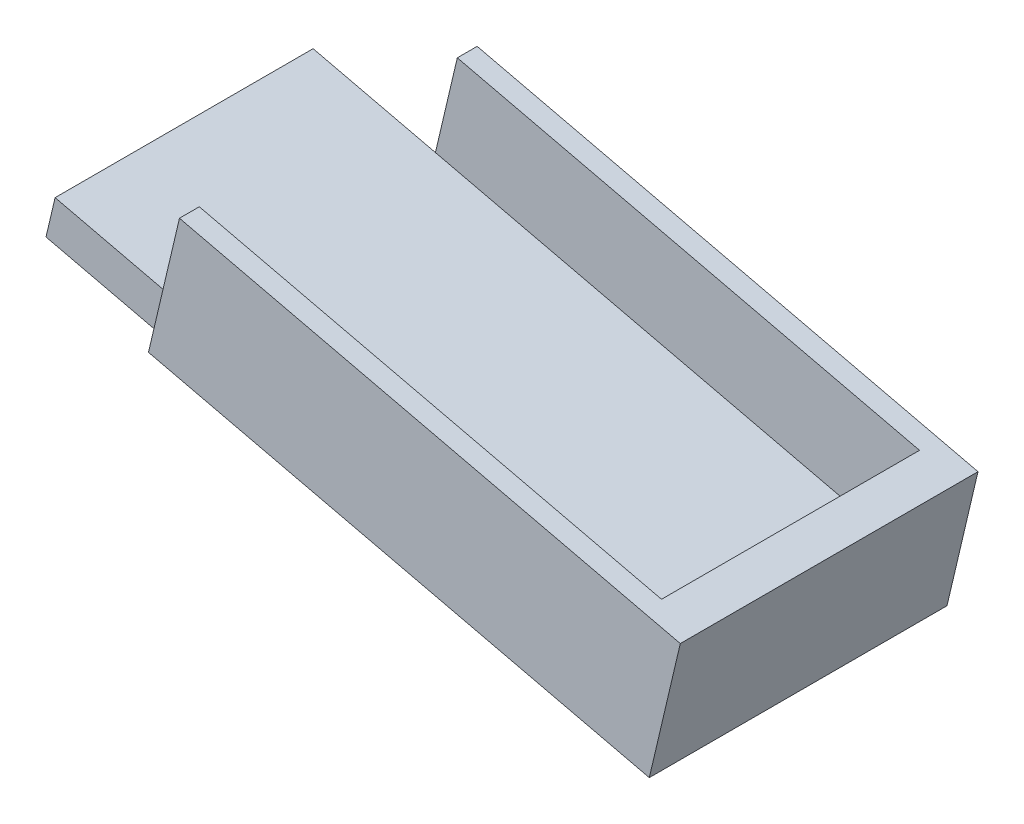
ISO-10303-21;
HEADER;
FILE_DESCRIPTION(('STEP AP214'),'2;1');
FILE_NAME('part.step','',(''),(''),'','','');
FILE_SCHEMA(('AUTOMOTIVE_DESIGN { 1 0 10303 214 1 1 1 1 }'));
ENDSEC;
DATA;
#1=APPLICATION_CONTEXT('core data for automotive mechanical design processes');
#2=APPLICATION_PROTOCOL_DEFINITION('international standard','automotive_design',2000,#1);
#3=PRODUCT_CONTEXT('',#1,'mechanical');
#4=PRODUCT('Part','Part','',(#3));
#5=PRODUCT_RELATED_PRODUCT_CATEGORY('part','',(#4));
#6=PRODUCT_DEFINITION_FORMATION('','',#4);
#7=PRODUCT_DEFINITION_CONTEXT('part definition',#1,'design');
#8=PRODUCT_DEFINITION('design','',#6,#7);
#9=PRODUCT_DEFINITION_SHAPE('','',#8);
#10=(LENGTH_UNIT() NAMED_UNIT(*) SI_UNIT(.MILLI.,.METRE.));
#11=(NAMED_UNIT(*) PLANE_ANGLE_UNIT() SI_UNIT($,.RADIAN.));
#12=(NAMED_UNIT(*) SI_UNIT($,.STERADIAN.) SOLID_ANGLE_UNIT());
#13=UNCERTAINTY_MEASURE_WITH_UNIT(LENGTH_MEASURE(1.E-05),#10,'distance_accuracy_value','');
#14=(GEOMETRIC_REPRESENTATION_CONTEXT(3) GLOBAL_UNCERTAINTY_ASSIGNED_CONTEXT((#13)) GLOBAL_UNIT_ASSIGNED_CONTEXT((#10,
#11,#12)) REPRESENTATION_CONTEXT('',''));
#15=CARTESIAN_POINT('',(0.,0.,0.));
#16=DIRECTION('',(0.,0.,1.));
#17=DIRECTION('',(1.,0.,0.));
#18=AXIS2_PLACEMENT_3D('',#15,#16,#17);
#19=CARTESIAN_POINT('',(161.696938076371,-47.053294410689,65.));
#20=DIRECTION('',(0.,0.,-1.));
#21=DIRECTION('',(-1.,0.,0.));
#22=AXIS2_PLACEMENT_3D('',#19,#20,#21);
#23=PLANE('',#22);
#24=DIRECTION('',(-0.22919193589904,-0.973381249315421,0.));
#25=VECTOR('',#24,1.);
#26=CARTESIAN_POINT('',(35.5202878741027,-17.3437938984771,65.));
#27=LINE('',#26,#25);
#28=CARTESIAN_POINT('',(30.0036065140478,-40.773214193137,65.));
#29=VERTEX_POINT('',#28);
#30=CARTESIAN_POINT('',(27.7116871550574,-50.5070266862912,65.));
#31=VERTEX_POINT('',#30);
#32=EDGE_CURVE('E11',#29,#31,#27,.T.);
#33=ORIENTED_EDGE('',*,*,#32,.F.);
#34=DIRECTION('',(0.973381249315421,-0.229191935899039,0.));
#35=VECTOR('',#34,1.);
#36=CARTESIAN_POINT('',(-0.811545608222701,-33.5174915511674,65.));
#37=LINE('',#36,#35);
#38=CARTESIAN_POINT('',(-0.811545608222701,-33.5174915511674,65.));
#39=VERTEX_POINT('',#38);
#40=EDGE_CURVE('E187',#39,#29,#37,.T.);
#41=ORIENTED_EDGE('',*,*,#40,.F.);
#42=DIRECTION('',(0.229191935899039,0.973381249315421,0.));
#43=VECTOR('',#42,1.);
#44=CARTESIAN_POINT('',(-3.10346496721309,-43.2513040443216,65.));
#45=LINE('',#44,#43);
#46=CARTESIAN_POINT('',(-3.10346496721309,-43.2513040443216,65.));
#47=VERTEX_POINT('',#46);
#48=EDGE_CURVE('E189',#47,#39,#45,.T.);
#49=ORIENTED_EDGE('',*,*,#48,.F.);
#50=DIRECTION('',(0.973381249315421,-0.229191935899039,0.));
#51=VECTOR('',#50,1.);
#52=CARTESIAN_POINT('',(-3.10346496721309,-43.2513040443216,65.));
#53=LINE('',#52,#51);
#54=EDGE_CURVE('E128',#47,#31,#53,.T.);
#55=ORIENTED_EDGE('',*,*,#54,.T.);
#56=EDGE_LOOP('',(#33,#41,#49,#55));
#57=FACE_BOUND('',#56,.T.);
#58=ADVANCED_FACE('F32',(#57),#23,.F.);
#59=CARTESIAN_POINT('',(156.180256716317,-70.4827147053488,65.));
#60=DIRECTION('',(-0.973381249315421,0.22919193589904,0.));
#61=DIRECTION('',(-0.22919193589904,-0.973381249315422,0.));
#62=AXIS2_PLACEMENT_3D('',#59,#60,#61);
#63=PLANE('',#62);
#64=DIRECTION('',(0.,0.,-1.));
#65=VECTOR('',#64,1.);
#66=CARTESIAN_POINT('',(153.888337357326,-80.216527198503,65.));
#67=LINE('',#66,#65);
#68=CARTESIAN_POINT('',(153.888337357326,-80.216527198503,70.));
#69=VERTEX_POINT('',#68);
#70=CARTESIAN_POINT('',(153.888337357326,-80.216527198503,-5.));
#71=VERTEX_POINT('',#70);
#72=EDGE_CURVE('E118',#69,#71,#67,.T.);
#73=ORIENTED_EDGE('',*,*,#72,.T.);
#74=DIRECTION('',(-0.22919193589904,-0.973381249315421,0.));
#75=VECTOR('',#74,1.);
#76=CARTESIAN_POINT('',(153.888337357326,-80.216527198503,-5.));
#77=LINE('',#76,#75);
#78=CARTESIAN_POINT('',(161.696938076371,-47.053294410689,-5.));
#79=VERTEX_POINT('',#78);
#80=EDGE_CURVE('E121',#79,#71,#77,.T.);
#81=ORIENTED_EDGE('',*,*,#80,.F.);
#82=DIRECTION('',(0.,0.,-1.));
#83=VECTOR('',#82,1.);
#84=CARTESIAN_POINT('',(161.696938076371,-47.053294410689,65.));
#85=LINE('',#84,#83);
#86=CARTESIAN_POINT('',(161.696938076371,-47.053294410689,70.));
#87=VERTEX_POINT('',#86);
#88=EDGE_CURVE('E42',#87,#79,#85,.T.);
#89=ORIENTED_EDGE('',*,*,#88,.F.);
#90=DIRECTION('',(0.22919193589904,0.973381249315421,0.));
#91=VECTOR('',#90,1.);
#92=CARTESIAN_POINT('',(161.696938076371,-47.053294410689,70.));
#93=LINE('',#92,#91);
#94=EDGE_CURVE('E123',#69,#87,#93,.T.);
#95=ORIENTED_EDGE('',*,*,#94,.F.);
#96=EDGE_LOOP('',(#73,#81,#89,#95));
#97=FACE_BOUND('',#96,.T.);
#98=ADVANCED_FACE('F34',(#97),#63,.F.);
#99=CARTESIAN_POINT('',(151.963125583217,-44.7613750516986,65.));
#100=DIRECTION('',(0.229191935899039,0.973381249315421,0.));
#101=DIRECTION('',(-0.973381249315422,0.229191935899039,0.));
#102=AXIS2_PLACEMENT_3D('',#99,#100,#101);
#103=PLANE('',#102);
#104=ORIENTED_EDGE('',*,*,#88,.T.);
#105=DIRECTION('',(0.973381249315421,-0.229191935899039,0.));
#106=VECTOR('',#105,1.);
#107=CARTESIAN_POINT('',(161.696938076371,-47.053294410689,-5.));
#108=LINE('',#107,#106);
#109=CARTESIAN_POINT('',(35.5202878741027,-17.3437938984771,-5.));
#110=VERTEX_POINT('',#109);
#111=EDGE_CURVE('E142',#110,#79,#108,.T.);
#112=ORIENTED_EDGE('',*,*,#111,.F.);
#113=DIRECTION('',(0.,0.,1.));
#114=VECTOR('',#113,1.);
#115=CARTESIAN_POINT('',(35.5202878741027,-17.3437938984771,-5.));
#116=LINE('',#115,#114);
#117=CARTESIAN_POINT('',(35.5202878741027,-17.3437938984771,0.));
#118=VERTEX_POINT('',#117);
#119=EDGE_CURVE('E150',#110,#118,#116,.T.);
#120=ORIENTED_EDGE('',*,*,#119,.T.);
#121=DIRECTION('',(0.973381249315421,-0.229191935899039,0.));
#122=VECTOR('',#121,1.);
#123=CARTESIAN_POINT('',(161.696938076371,-47.053294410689,0.));
#124=LINE('',#123,#122);
#125=CARTESIAN_POINT('',(151.963125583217,-44.7613750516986,0.));
#126=VERTEX_POINT('',#125);
#127=EDGE_CURVE('E143',#118,#126,#124,.T.);
#128=ORIENTED_EDGE('',*,*,#127,.T.);
#129=DIRECTION('',(0.,0.,-1.));
#130=VECTOR('',#129,1.);
#131=CARTESIAN_POINT('',(151.963125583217,-44.7613750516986,65.));
#132=LINE('',#131,#130);
#133=CARTESIAN_POINT('',(151.963125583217,-44.7613750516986,65.));
#134=VERTEX_POINT('',#133);
#135=EDGE_CURVE('E204',#134,#126,#132,.T.);
#136=ORIENTED_EDGE('',*,*,#135,.F.);
#137=DIRECTION('',(-0.973381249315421,0.229191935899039,0.));
#138=VECTOR('',#137,1.);
#139=CARTESIAN_POINT('',(161.696938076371,-47.053294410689,65.));
#140=LINE('',#139,#138);
#141=CARTESIAN_POINT('',(35.5202878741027,-17.3437938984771,65.));
#142=VERTEX_POINT('',#141);
#143=EDGE_CURVE('E162',#134,#142,#140,.T.);
#144=ORIENTED_EDGE('',*,*,#143,.T.);
#145=DIRECTION('',(0.,0.,-1.));
#146=VECTOR('',#145,1.);
#147=CARTESIAN_POINT('',(35.5202878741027,-17.3437938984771,70.));
#148=LINE('',#147,#146);
#149=CARTESIAN_POINT('',(35.5202878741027,-17.3437938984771,70.));
#150=VERTEX_POINT('',#149);
#151=EDGE_CURVE('E186',#150,#142,#148,.T.);
#152=ORIENTED_EDGE('',*,*,#151,.F.);
#153=DIRECTION('',(-0.973381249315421,0.229191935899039,0.));
#154=VECTOR('',#153,1.);
#155=CARTESIAN_POINT('',(161.696938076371,-47.053294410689,70.));
#156=LINE('',#155,#154);
#157=EDGE_CURVE('E172',#87,#150,#156,.T.);
#158=ORIENTED_EDGE('',*,*,#157,.F.);
#159=EDGE_LOOP('',(#104,#112,#120,#128,#136,#144,#152,#158));
#160=FACE_BOUND('',#159,.T.);
#161=ADVANCED_FACE('F257',(#160),#103,.T.);
#162=CARTESIAN_POINT('',(146.446444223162,-68.1907953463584,65.));
#163=DIRECTION('',(-0.973381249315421,0.22919193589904,0.));
#164=DIRECTION('',(-0.22919193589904,-0.973381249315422,0.));
#165=AXIS2_PLACEMENT_3D('',#162,#163,#164);
#166=PLANE('',#165);
#167=DIRECTION('',(0.22919193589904,0.973381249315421,0.));
#168=VECTOR('',#167,1.);
#169=CARTESIAN_POINT('',(146.446444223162,-68.1907953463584,0.));
#170=LINE('',#169,#168);
#171=CARTESIAN_POINT('',(146.446444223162,-68.1907953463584,0.));
#172=VERTEX_POINT('',#171);
#173=EDGE_CURVE('E36',#172,#126,#170,.T.);
#174=ORIENTED_EDGE('',*,*,#173,.F.);
#175=DIRECTION('',(0.,0.,-1.));
#176=VECTOR('',#175,1.);
#177=CARTESIAN_POINT('',(146.446444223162,-68.1907953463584,65.));
#178=LINE('',#177,#176);
#179=CARTESIAN_POINT('',(146.446444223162,-68.1907953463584,65.));
#180=VERTEX_POINT('',#179);
#181=EDGE_CURVE('E206',#180,#172,#178,.T.);
#182=ORIENTED_EDGE('',*,*,#181,.F.);
#183=DIRECTION('',(0.22919193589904,0.973381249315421,0.));
#184=VECTOR('',#183,1.);
#185=CARTESIAN_POINT('',(146.446444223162,-68.1907953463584,65.));
#186=LINE('',#185,#184);
#187=EDGE_CURVE('E209',#180,#134,#186,.T.);
#188=ORIENTED_EDGE('',*,*,#187,.T.);
#189=ORIENTED_EDGE('',*,*,#135,.T.);
#190=EDGE_LOOP('',(#174,#182,#188,#189));
#191=FACE_BOUND('',#190,.T.);
#192=ADVANCED_FACE('F235',(#191),#166,.T.);
#193=CARTESIAN_POINT('',(-0.811545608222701,-33.5174915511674,65.));
#194=DIRECTION('',(0.229191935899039,0.973381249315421,0.));
#195=DIRECTION('',(-0.973381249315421,0.229191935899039,0.));
#196=AXIS2_PLACEMENT_3D('',#193,#194,#195);
#197=PLANE('',#196);
#198=DIRECTION('',(0.973381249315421,-0.229191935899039,0.));
#199=VECTOR('',#198,1.);
#200=CARTESIAN_POINT('',(-0.811545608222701,-33.5174915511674,0.));
#201=LINE('',#200,#199);
#202=CARTESIAN_POINT('',(-0.811545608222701,-33.5174915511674,0.));
#203=VERTEX_POINT('',#202);
#204=CARTESIAN_POINT('',(30.0036065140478,-40.773214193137,0.));
#205=VERTEX_POINT('',#204);
#206=EDGE_CURVE('E218',#203,#205,#201,.T.);
#207=ORIENTED_EDGE('',*,*,#206,.F.);
#208=DIRECTION('',(0.,0.,-1.));
#209=VECTOR('',#208,1.);
#210=CARTESIAN_POINT('',(-0.811545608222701,-33.5174915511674,65.));
#211=LINE('',#210,#209);
#212=EDGE_CURVE('E225',#39,#203,#211,.T.);
#213=ORIENTED_EDGE('',*,*,#212,.F.);
#214=ORIENTED_EDGE('',*,*,#40,.T.);
#215=EDGE_CURVE('E190',#29,#180,#37,.T.);
#216=ORIENTED_EDGE('',*,*,#215,.T.);
#217=ORIENTED_EDGE('',*,*,#181,.T.);
#218=EDGE_CURVE('E221',#205,#172,#201,.T.);
#219=ORIENTED_EDGE('',*,*,#218,.F.);
#220=EDGE_LOOP('',(#207,#213,#214,#216,#217,#219));
#221=FACE_BOUND('',#220,.T.);
#222=ADVANCED_FACE('F230',(#221),#197,.T.);
#223=CARTESIAN_POINT('',(-3.10346496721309,-43.2513040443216,65.));
#224=DIRECTION('',(-0.973381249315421,0.229191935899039,0.));
#225=DIRECTION('',(-0.229191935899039,-0.973381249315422,0.));
#226=AXIS2_PLACEMENT_3D('',#223,#224,#225);
#227=PLANE('',#226);
#228=DIRECTION('',(0.229191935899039,0.973381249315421,0.));
#229=VECTOR('',#228,1.);
#230=CARTESIAN_POINT('',(-3.10346496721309,-43.2513040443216,0.));
#231=LINE('',#230,#229);
#232=CARTESIAN_POINT('',(-3.10346496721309,-43.2513040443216,0.));
#233=VERTEX_POINT('',#232);
#234=EDGE_CURVE('E216',#233,#203,#231,.T.);
#235=ORIENTED_EDGE('',*,*,#234,.F.);
#236=DIRECTION('',(0.,0.,-1.));
#237=VECTOR('',#236,1.);
#238=CARTESIAN_POINT('',(-3.10346496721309,-43.2513040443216,65.));
#239=LINE('',#238,#237);
#240=EDGE_CURVE('E127',#47,#233,#239,.T.);
#241=ORIENTED_EDGE('',*,*,#240,.F.);
#242=ORIENTED_EDGE('',*,*,#48,.T.);
#243=ORIENTED_EDGE('',*,*,#212,.T.);
#244=EDGE_LOOP('',(#235,#241,#242,#243));
#245=FACE_BOUND('',#244,.T.);
#246=ADVANCED_FACE('F266',(#245),#227,.T.);
#247=CARTESIAN_POINT('',(-3.10346496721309,-43.2513040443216,65.));
#248=DIRECTION('',(0.229191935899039,0.973381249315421,0.));
#249=DIRECTION('',(-0.973381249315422,0.229191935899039,0.));
#250=AXIS2_PLACEMENT_3D('',#247,#248,#249);
#251=PLANE('',#250);
#252=DIRECTION('',(0.973381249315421,-0.229191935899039,0.));
#253=VECTOR('',#252,1.);
#254=CARTESIAN_POINT('',(-3.10346496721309,-43.2513040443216,0.));
#255=LINE('',#254,#253);
#256=CARTESIAN_POINT('',(27.7116871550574,-50.5070266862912,0.));
#257=VERTEX_POINT('',#256);
#258=EDGE_CURVE('E159',#233,#257,#255,.T.);
#259=ORIENTED_EDGE('',*,*,#258,.T.);
#260=DIRECTION('',(0.,0.,1.));
#261=VECTOR('',#260,1.);
#262=CARTESIAN_POINT('',(27.7116871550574,-50.5070266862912,-5.));
#263=LINE('',#262,#261);
#264=CARTESIAN_POINT('',(27.7116871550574,-50.5070266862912,-5.));
#265=VERTEX_POINT('',#264);
#266=EDGE_CURVE('E134',#265,#257,#263,.T.);
#267=ORIENTED_EDGE('',*,*,#266,.F.);
#268=DIRECTION('',(-0.973381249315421,0.22919193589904,0.));
#269=VECTOR('',#268,1.);
#270=CARTESIAN_POINT('',(27.7116871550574,-50.5070266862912,-5.));
#271=LINE('',#270,#269);
#272=EDGE_CURVE('E131',#71,#265,#271,.T.);
#273=ORIENTED_EDGE('',*,*,#272,.F.);
#274=ORIENTED_EDGE('',*,*,#72,.F.);
#275=DIRECTION('',(0.973381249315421,-0.22919193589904,0.));
#276=VECTOR('',#275,1.);
#277=CARTESIAN_POINT('',(153.888337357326,-80.216527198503,70.));
#278=LINE('',#277,#276);
#279=CARTESIAN_POINT('',(27.7116871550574,-50.5070266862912,70.));
#280=VERTEX_POINT('',#279);
#281=EDGE_CURVE('E177',#280,#69,#278,.T.);
#282=ORIENTED_EDGE('',*,*,#281,.F.);
#283=DIRECTION('',(0.,0.,-1.));
#284=VECTOR('',#283,1.);
#285=CARTESIAN_POINT('',(27.7116871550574,-50.5070266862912,70.));
#286=LINE('',#285,#284);
#287=EDGE_CURVE('E180',#280,#31,#286,.T.);
#288=ORIENTED_EDGE('',*,*,#287,.T.);
#289=ORIENTED_EDGE('',*,*,#54,.F.);
#290=ORIENTED_EDGE('',*,*,#240,.T.);
#291=EDGE_LOOP('',(#259,#267,#273,#274,#282,#288,#289,#290));
#292=FACE_BOUND('',#291,.T.);
#293=ADVANCED_FACE('F132',(#292),#251,.F.);
#294=CARTESIAN_POINT('',(161.696938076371,-47.053294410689,0.));
#295=DIRECTION('',(0.,0.,-1.));
#296=DIRECTION('',(-1.,0.,0.));
#297=AXIS2_PLACEMENT_3D('',#294,#295,#296);
#298=PLANE('',#297);
#299=DIRECTION('',(0.22919193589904,0.973381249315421,0.));
#300=VECTOR('',#299,1.);
#301=CARTESIAN_POINT('',(35.5202878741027,-17.3437938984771,0.));
#302=LINE('',#301,#300);
#303=EDGE_CURVE('E50',#257,#205,#302,.T.);
#304=ORIENTED_EDGE('',*,*,#303,.F.);
#305=ORIENTED_EDGE('',*,*,#258,.F.);
#306=ORIENTED_EDGE('',*,*,#234,.T.);
#307=ORIENTED_EDGE('',*,*,#206,.T.);
#308=EDGE_LOOP('',(#304,#305,#306,#307));
#309=FACE_BOUND('',#308,.T.);
#310=ADVANCED_FACE('F261',(#309),#298,.T.);
#311=CARTESIAN_POINT('',(35.5202878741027,-17.3437938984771,70.));
#312=DIRECTION('',(0.973381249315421,-0.22919193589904,0.));
#313=DIRECTION('',(0.22919193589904,0.973381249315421,0.));
#314=AXIS2_PLACEMENT_3D('',#311,#312,#313);
#315=PLANE('',#314);
#316=EDGE_CURVE('E165',#142,#29,#27,.T.);
#317=ORIENTED_EDGE('',*,*,#316,.T.);
#318=ORIENTED_EDGE('',*,*,#32,.T.);
#319=ORIENTED_EDGE('',*,*,#287,.F.);
#320=DIRECTION('',(-0.22919193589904,-0.973381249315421,0.));
#321=VECTOR('',#320,1.);
#322=CARTESIAN_POINT('',(35.5202878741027,-17.3437938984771,70.));
#323=LINE('',#322,#321);
#324=EDGE_CURVE('E175',#150,#280,#323,.T.);
#325=ORIENTED_EDGE('',*,*,#324,.F.);
#326=ORIENTED_EDGE('',*,*,#151,.T.);
#327=EDGE_LOOP('',(#317,#318,#319,#325,#326));
#328=FACE_BOUND('',#327,.T.);
#329=ADVANCED_FACE('F260',(#328),#315,.F.);
#330=CARTESIAN_POINT('',(35.5202878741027,-17.3437938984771,70.));
#331=DIRECTION('',(0.,0.,1.));
#332=DIRECTION('',(1.,0.,0.));
#333=AXIS2_PLACEMENT_3D('',#330,#331,#332);
#334=PLANE('',#333);
#335=ORIENTED_EDGE('',*,*,#157,.T.);
#336=ORIENTED_EDGE('',*,*,#324,.T.);
#337=ORIENTED_EDGE('',*,*,#281,.T.);
#338=ORIENTED_EDGE('',*,*,#94,.T.);
#339=EDGE_LOOP('',(#335,#336,#337,#338));
#340=FACE_BOUND('',#339,.T.);
#341=ADVANCED_FACE('F247',(#340),#334,.T.);
#342=CARTESIAN_POINT('',(35.5202878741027,-17.3437938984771,65.));
#343=DIRECTION('',(0.,0.,1.));
#344=DIRECTION('',(1.,0.,0.));
#345=AXIS2_PLACEMENT_3D('',#342,#343,#344);
#346=PLANE('',#345);
#347=ORIENTED_EDGE('',*,*,#187,.F.);
#348=ORIENTED_EDGE('',*,*,#215,.F.);
#349=ORIENTED_EDGE('',*,*,#316,.F.);
#350=ORIENTED_EDGE('',*,*,#143,.F.);
#351=EDGE_LOOP('',(#347,#348,#349,#350));
#352=FACE_BOUND('',#351,.T.);
#353=ADVANCED_FACE('F240',(#352),#346,.F.);
#354=CARTESIAN_POINT('',(35.5202878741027,-17.3437938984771,-5.));
#355=DIRECTION('',(0.973381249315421,-0.22919193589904,0.));
#356=DIRECTION('',(0.22919193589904,0.973381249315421,0.));
#357=AXIS2_PLACEMENT_3D('',#354,#355,#356);
#358=PLANE('',#357);
#359=ORIENTED_EDGE('',*,*,#303,.T.);
#360=EDGE_CURVE('E151',#205,#118,#302,.T.);
#361=ORIENTED_EDGE('',*,*,#360,.T.);
#362=ORIENTED_EDGE('',*,*,#119,.F.);
#363=DIRECTION('',(0.22919193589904,0.973381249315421,0.));
#364=VECTOR('',#363,1.);
#365=CARTESIAN_POINT('',(35.5202878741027,-17.3437938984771,-5.));
#366=LINE('',#365,#364);
#367=EDGE_CURVE('E137',#265,#110,#366,.T.);
#368=ORIENTED_EDGE('',*,*,#367,.F.);
#369=ORIENTED_EDGE('',*,*,#266,.T.);
#370=EDGE_LOOP('',(#359,#361,#362,#368,#369));
#371=FACE_BOUND('',#370,.T.);
#372=ADVANCED_FACE('F238',(#371),#358,.F.);
#373=CARTESIAN_POINT('',(161.696938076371,-47.053294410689,-5.));
#374=DIRECTION('',(0.,0.,1.));
#375=DIRECTION('',(1.,0.,0.));
#376=AXIS2_PLACEMENT_3D('',#373,#374,#375);
#377=PLANE('',#376);
#378=ORIENTED_EDGE('',*,*,#80,.T.);
#379=ORIENTED_EDGE('',*,*,#272,.T.);
#380=ORIENTED_EDGE('',*,*,#367,.T.);
#381=ORIENTED_EDGE('',*,*,#111,.T.);
#382=EDGE_LOOP('',(#378,#379,#380,#381));
#383=FACE_BOUND('',#382,.T.);
#384=ADVANCED_FACE('F140',(#383),#377,.F.);
#385=CARTESIAN_POINT('',(161.696938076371,-47.053294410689,0.));
#386=DIRECTION('',(0.,0.,1.));
#387=DIRECTION('',(1.,0.,0.));
#388=AXIS2_PLACEMENT_3D('',#385,#386,#387);
#389=PLANE('',#388);
#390=ORIENTED_EDGE('',*,*,#360,.F.);
#391=ORIENTED_EDGE('',*,*,#218,.T.);
#392=ORIENTED_EDGE('',*,*,#173,.T.);
#393=ORIENTED_EDGE('',*,*,#127,.F.);
#394=EDGE_LOOP('',(#390,#391,#392,#393));
#395=FACE_BOUND('',#394,.T.);
#396=ADVANCED_FACE('F237',(#395),#389,.T.);
#397=CLOSED_SHELL('',(#58,#98,#161,#192,#222,#246,#293,#310,#329,#341,#353,#372,#384,#396));
#398=MANIFOLD_SOLID_BREP('B2',#397);
#399=ADVANCED_BREP_SHAPE_REPRESENTATION('',(#18,#398),#14);
#400=SHAPE_DEFINITION_REPRESENTATION(#9,#399);
ENDSEC;
END-ISO-10303-21;
